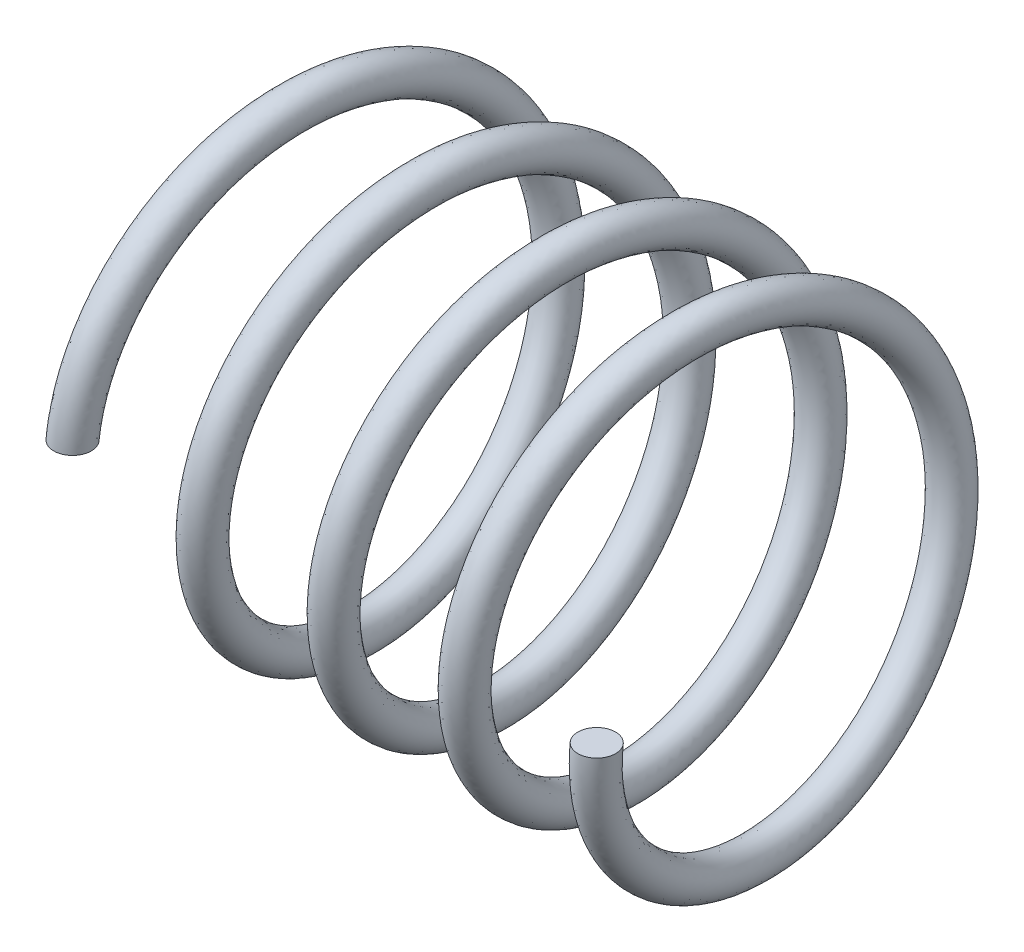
from build123d import *

# Parameters (mm, degrees)
SWEEP1_PITCH  = 3.81
SWEEP1_HEIGHT = 15.24
SWEEP1_RADIUS = 6.096
SKETCH2_R     = 0.5461


with BuildPart() as part:
    # Sweep1: sweep along a helix
    with BuildLine() as sweep1_path:
        Helix(SWEEP1_PITCH, SWEEP1_HEIGHT, SWEEP1_RADIUS, center=(0, 0, 0), direction=(1, 0, 0), lefthand=True)
    # Sketch2 → Sweep1 (sweep)
    with BuildSketch(Plane(origin=(0, 0, 0), x_dir=(1, 0, 0), z_dir=(0, 1, 0))):
        with Locations((0, -6.096)):
            Circle(SKETCH2_R)
    sweep(path=sweep1_path.line, is_frenet=True)


solid = part.part
